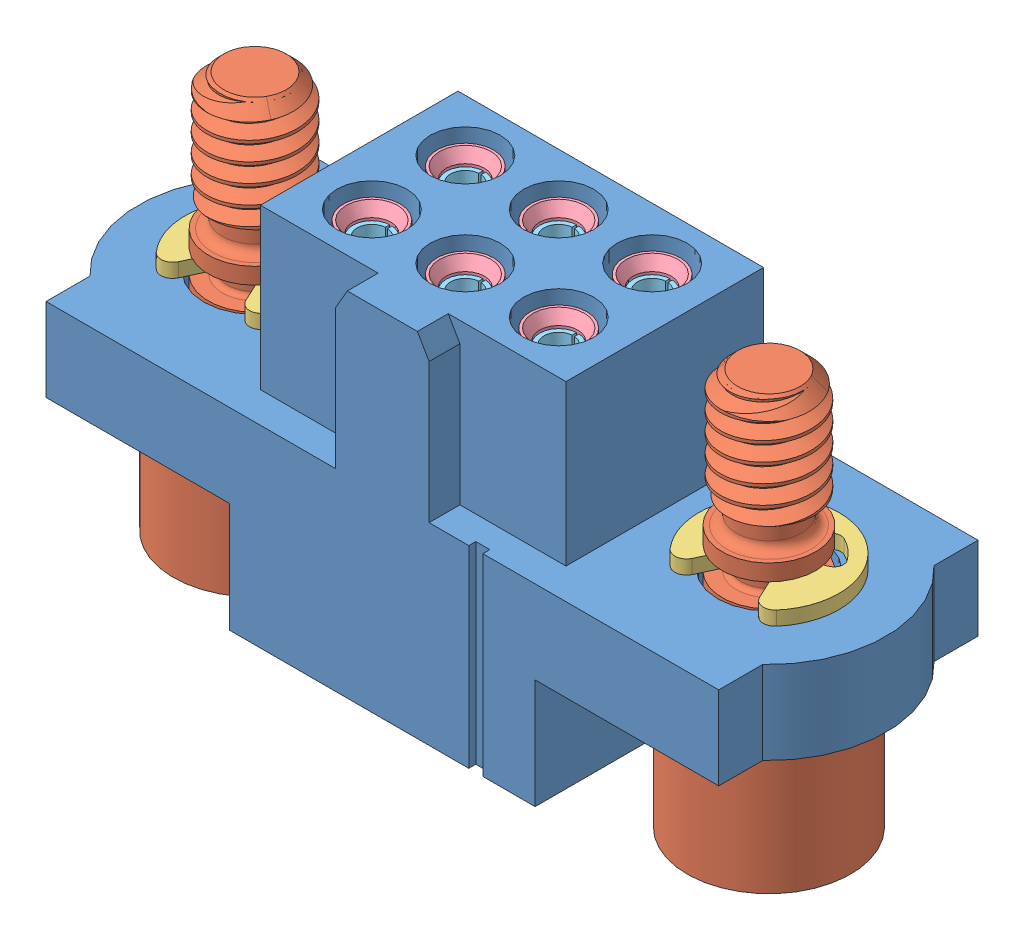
SolidWorks assembly m80-4810642_asm.SLDASM, configuration Default (file format 9000). Lengths in mm.
Overall size (16 8.5 5.55).
24 component instances, 5 part files, 0 mates.
Components (placement in the parent):
- M80-2662098_ASM_1-1: M80-2662098_ASM_1.sldasm [Default] at origin size (16 8.5 5.55)
  - M80-2625098_1-1: M80-2625098_1.sldprt [Default] at origin size (16 7.55 5.55)
  - M80-218_1-1: M80-218_1.sldprt [Default] at (5.5 -5.2 0) x (0.866025 0 -0.5) z (-0.5 0 -0.866025) size (3.5 8.5 3.5)
  - M80-218_1-2: M80-218_1.sldprt [Default] at (-5.5 -5.2 0) x (0.866025 0 0.5) z (0.5 0 -0.866025) size (3.5 8.5 3.5)
  - M80-215_1-1: M80-215_1.sldprt [Default] at (5.5 -3.12 0) size (3 0.3 2.57)
  - M80-215_1-2: M80-215_1.sldprt [Default] at (-5.5 -3.12 0) size (3 0.3 2.57)
- M80-013_ASM_1-1: M80-013_ASM_1.sldasm [Default] at (-2 -7.65 -1) x (-1 0 0) z (0 0 1) size (1.48 7.45 1.48)
  - M80-012_1-1: M80-012_1.sldprt [Default] at origin size (1.48 7.45 1.48)
  - Y3198_1-1: Y3198_1.sldprt [Default] at (0 -6.44 0) x (-1 0 0) z (0 0 1) size (0.86 1.68 0.86)
- M80-013_ASM_1-2: M80-013_ASM_1.sldasm [Default] at (0 -7.65 -1) x (-1 0 0) z (0 0 1) size (1.48 7.45 1.48)
  - M80-012_1-1: M80-012_1.sldprt [Default] at origin size (1.48 7.45 1.48)
  - Y3198_1-1: Y3198_1.sldprt [Default] at (0 -6.44 0) x (-1 0 0) z (0 0 1) size (0.86 1.68 0.86)
- M80-013_ASM_1-3: M80-013_ASM_1.sldasm [Default] at (2 -7.65 -1) x (-1 0 0) z (0 0 1) size (1.48 7.45 1.48)
  - M80-012_1-1: M80-012_1.sldprt [Default] at origin size (1.48 7.45 1.48)
  - Y3198_1-1: Y3198_1.sldprt [Default] at (0 -6.44 0) x (-1 0 0) z (0 0 1) size (0.86 1.68 0.86)
- M80-013_ASM_1-4: M80-013_ASM_1.sldasm [Default] at (-2 -7.65 1) x (-1 0 0) z (0 0 1) size (1.48 7.45 1.48)
  - M80-012_1-1: M80-012_1.sldprt [Default] at origin size (1.48 7.45 1.48)
  - Y3198_1-1: Y3198_1.sldprt [Default] at (0 -6.44 0) x (-1 0 0) z (0 0 1) size (0.86 1.68 0.86)
- M80-013_ASM_1-5: M80-013_ASM_1.sldasm [Default] at (0 -7.65 1) x (-1 0 0) z (0 0 1) size (1.48 7.45 1.48)
  - M80-012_1-1: M80-012_1.sldprt [Default] at origin size (1.48 7.45 1.48)
  - Y3198_1-1: Y3198_1.sldprt [Default] at (0 -6.44 0) x (-1 0 0) z (0 0 1) size (0.86 1.68 0.86)
- M80-013_ASM_1-6: M80-013_ASM_1.sldasm [Default] at (2 -7.65 1) x (-1 0 0) z (0 0 1) size (1.48 7.45 1.48)
  - M80-012_1-1: M80-012_1.sldprt [Default] at origin size (1.48 7.45 1.48)
  - Y3198_1-1: Y3198_1.sldprt [Default] at (0 -6.44 0) x (-1 0 0) z (0 0 1) size (0.86 1.68 0.86)
